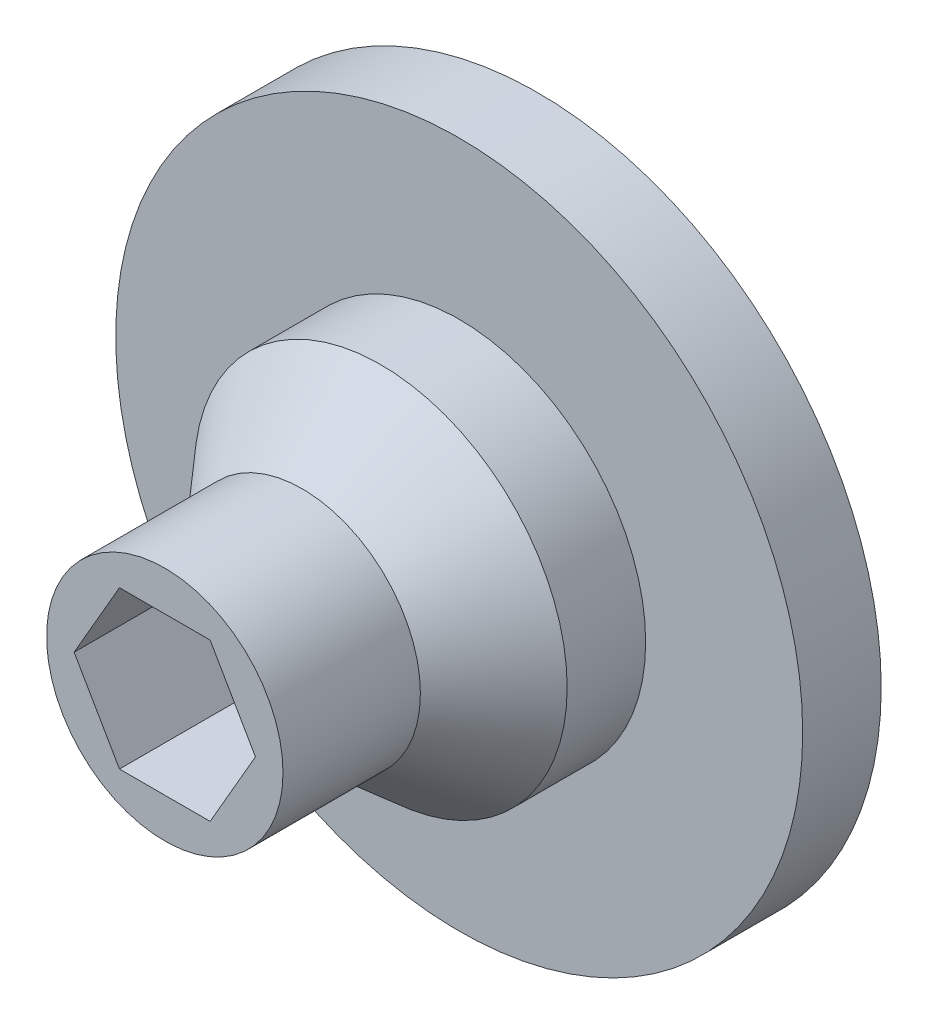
from build123d import *

# Parameters (mm, degrees)
ESQUISSE1_R             = 8.75
BASE_EXTRUSION_DEPTH    = 2
ESQUISSE3_R             = 4.75
BOSS_EXTRU_1_DEPTH      = 2
ESQUISSE4_R             = 4.75
BOSS_EXTRU_2_DEPTH      = 2
BOSS_EXTRU_2_TAPER      = 41
ESQUISSE5_R             = 3.011426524
BOSS_EXTRU_3_DEPTH      = 3.5
ENL_V_MAT_EXTRU_1_DEPTH = 16.600480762


with BuildPart() as part:
    # Esquisse1 → Base-Extrusion (new body)
    with BuildSketch(Plane.XY):
        Circle(ESQUISSE1_R)
    extrude(amount=BASE_EXTRUSION_DEPTH)

    # Esquisse3 → Boss.-Extru.1 (add)
    with BuildSketch(Plane.XY.offset(2)):
        Circle(ESQUISSE3_R)
    extrude(amount=BOSS_EXTRU_1_DEPTH)

    # Esquisse4 → Boss.-Extru.2 (add)
    with BuildSketch(Plane.XY.offset(4)):
        Circle(ESQUISSE4_R)
    extrude(amount=BOSS_EXTRU_2_DEPTH, taper=BOSS_EXTRU_2_TAPER)

    # Esquisse5 → Boss.-Extru.3 (add)
    with BuildSketch(Plane.XY.offset(6)):
        Circle(ESQUISSE5_R)
    extrude(amount=BOSS_EXTRU_3_DEPTH)

    # Esquisse6 → Enl_v. mat.-Extru.1 (cut, through all)
    with BuildSketch(Plane(origin=(0, 0, 9.5), x_dir=(-1, 0, 0), z_dir=(0, 0, -1))):
        Polygon((1.154700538, 2), (-1.154700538, 2), (-2.309401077, 0), (-1.154700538, -2), (1.154700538, -2), (2.309401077, 0), align=None)
    extrude(amount=ENL_V_MAT_EXTRU_1_DEPTH, mode=Mode.SUBTRACT)


solid = part.part
